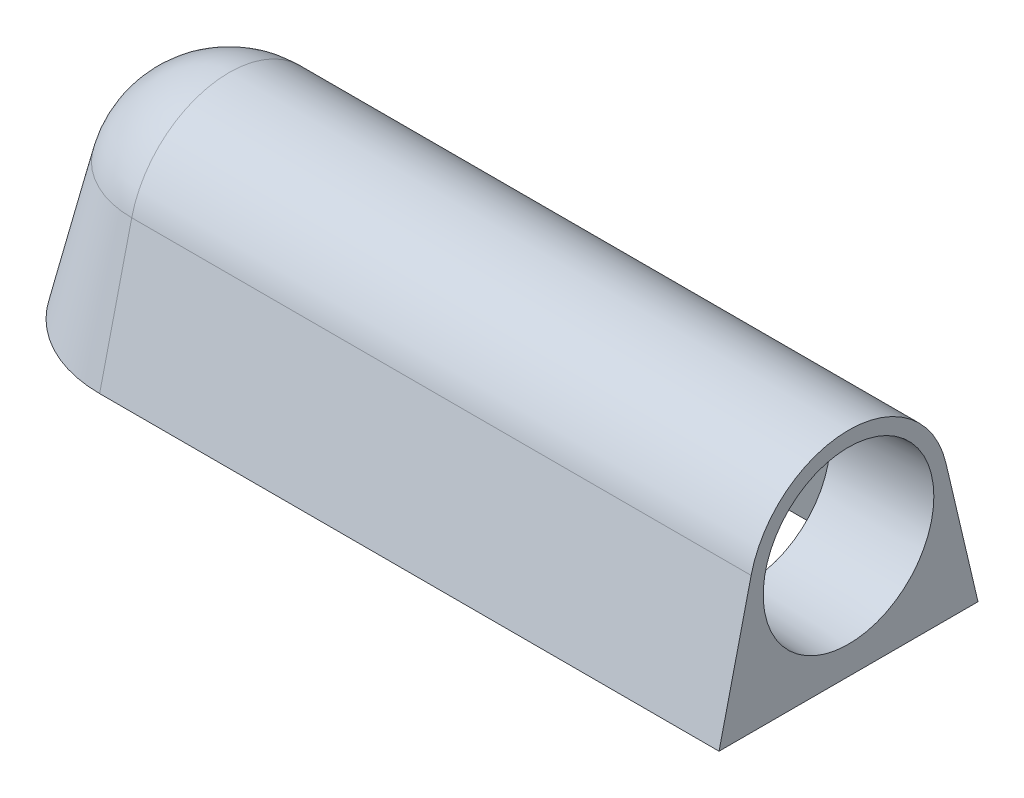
ISO-10303-21;
HEADER;
FILE_DESCRIPTION(('STEP AP214'),'2;1');
FILE_NAME('part.step','',(''),(''),'','','');
FILE_SCHEMA(('AUTOMOTIVE_DESIGN { 1 0 10303 214 1 1 1 1 }'));
ENDSEC;
DATA;
#1=APPLICATION_CONTEXT('core data for automotive mechanical design processes');
#2=APPLICATION_PROTOCOL_DEFINITION('international standard','automotive_design',2000,#1);
#3=PRODUCT_CONTEXT('',#1,'mechanical');
#4=PRODUCT('Part','Part','',(#3));
#5=PRODUCT_RELATED_PRODUCT_CATEGORY('part','',(#4));
#6=PRODUCT_DEFINITION_FORMATION('','',#4);
#7=PRODUCT_DEFINITION_CONTEXT('part definition',#1,'design');
#8=PRODUCT_DEFINITION('design','',#6,#7);
#9=PRODUCT_DEFINITION_SHAPE('','',#8);
#10=(LENGTH_UNIT() NAMED_UNIT(*) SI_UNIT(.MILLI.,.METRE.));
#11=(NAMED_UNIT(*) PLANE_ANGLE_UNIT() SI_UNIT($,.RADIAN.));
#12=(NAMED_UNIT(*) SI_UNIT($,.STERADIAN.) SOLID_ANGLE_UNIT());
#13=UNCERTAINTY_MEASURE_WITH_UNIT(LENGTH_MEASURE(1.E-05),#10,'distance_accuracy_value','');
#14=(GEOMETRIC_REPRESENTATION_CONTEXT(3) GLOBAL_UNCERTAINTY_ASSIGNED_CONTEXT((#13)) GLOBAL_UNIT_ASSIGNED_CONTEXT((#10,
#11,#12)) REPRESENTATION_CONTEXT('',''));
#15=CARTESIAN_POINT('',(0.,0.,0.));
#16=DIRECTION('',(0.,0.,1.));
#17=DIRECTION('',(1.,0.,0.));
#18=AXIS2_PLACEMENT_3D('',#15,#16,#17);
#19=CARTESIAN_POINT('',(0.,9.779,0.));
#20=DIRECTION('',(0.,-1.,0.));
#21=DIRECTION('',(0.,0.,1.));
#22=AXIS2_PLACEMENT_3D('',#19,#20,#21);
#23=SPHERICAL_SURFACE('',#22,8.636);
#24=CARTESIAN_POINT('',(0.,11.7591650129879,0.));
#25=DIRECTION('',(0.,-1.,0.));
#26=DIRECTION('',(0.,0.,-1.));
#27=AXIS2_PLACEMENT_3D('',#24,#25,#26);
#28=CIRCLE('',#27,8.40591711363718);
#29=CARTESIAN_POINT('',(0.,11.7591650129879,8.40591711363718));
#30=VERTEX_POINT('',#29);
#31=CARTESIAN_POINT('',(0.,11.7591650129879,-8.40591711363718));
#32=VERTEX_POINT('',#31);
#33=EDGE_CURVE('E11',#30,#32,#28,.T.);
#34=ORIENTED_EDGE('',*,*,#33,.F.);
#35=CARTESIAN_POINT('',(0.,9.779,0.));
#36=DIRECTION('',(-1.,0.,0.));
#37=DIRECTION('',(0.,0.,-1.));
#38=AXIS2_PLACEMENT_3D('',#35,#36,#37);
#39=CIRCLE('',#38,8.636);
#40=EDGE_CURVE('E223',#30,#32,#39,.T.);
#41=ORIENTED_EDGE('',*,*,#40,.T.);
#42=EDGE_LOOP('',(#34,#41));
#43=FACE_BOUND('',#42,.T.);
#44=ADVANCED_FACE('F28',(#43),#23,.T.);
#45=CARTESIAN_POINT('',(0.,0.,0.));
#46=DIRECTION('',(0.,-1.,0.));
#47=DIRECTION('',(0.,0.,-1.));
#48=AXIS2_PLACEMENT_3D('',#45,#46,#47);
#49=CONICAL_SURFACE('',#48,11.176,0.231350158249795);
#50=CARTESIAN_POINT('',(0.,0.,0.));
#51=DIRECTION('',(0.,-1.,0.));
#52=DIRECTION('',(0.,0.,-1.));
#53=AXIS2_PLACEMENT_3D('',#50,#51,#52);
#54=CIRCLE('',#53,11.176);
#55=CARTESIAN_POINT('',(0.,0.,11.176));
#56=VERTEX_POINT('',#55);
#57=CARTESIAN_POINT('',(0.,0.,-11.176));
#58=VERTEX_POINT('',#57);
#59=EDGE_CURVE('E35',#56,#58,#54,.T.);
#60=ORIENTED_EDGE('',*,*,#59,.F.);
#61=DIRECTION('',(0.,0.973357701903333,-0.229291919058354));
#62=VECTOR('',#61,1.);
#63=CARTESIAN_POINT('',(0.,11.7591650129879,8.40591711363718));
#64=LINE('',#63,#62);
#65=EDGE_CURVE('E219',#56,#30,#64,.T.);
#66=ORIENTED_EDGE('',*,*,#65,.T.);
#67=ORIENTED_EDGE('',*,*,#33,.T.);
#68=DIRECTION('',(0.,0.973357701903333,0.229291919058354));
#69=VECTOR('',#68,1.);
#70=CARTESIAN_POINT('',(0.,11.7591650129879,-8.40591711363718));
#71=LINE('',#70,#69);
#72=EDGE_CURVE('E220',#58,#32,#71,.T.);
#73=ORIENTED_EDGE('',*,*,#72,.F.);
#74=EDGE_LOOP('',(#60,#66,#67,#73));
#75=FACE_BOUND('',#74,.T.);
#76=ADVANCED_FACE('F206',(#75),#49,.T.);
#77=CARTESIAN_POINT('',(0.,0.,11.176));
#78=DIRECTION('',(0.,-1.,0.));
#79=DIRECTION('',(0.,0.,-1.));
#80=AXIS2_PLACEMENT_3D('',#77,#78,#79);
#81=PLANE('',#80);
#82=CARTESIAN_POINT('',(0.,0.,0.));
#83=DIRECTION('',(0.,-1.,0.));
#84=DIRECTION('',(0.,0.,-1.));
#85=AXIS2_PLACEMENT_3D('',#82,#83,#84);
#86=CIRCLE('',#85,9.87123814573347);
#87=CARTESIAN_POINT('',(0.,0.,9.87123814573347));
#88=VERTEX_POINT('',#87);
#89=CARTESIAN_POINT('',(0.,0.,-9.87123814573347));
#90=VERTEX_POINT('',#89);
#91=EDGE_CURVE('E125',#88,#90,#86,.T.);
#92=ORIENTED_EDGE('',*,*,#91,.F.);
#93=DIRECTION('',(-1.,0.,0.));
#94=VECTOR('',#93,1.);
#95=CARTESIAN_POINT('',(53.4670000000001,0.,9.87123814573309));
#96=LINE('',#95,#94);
#97=CARTESIAN_POINT('',(52.1970000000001,0.,9.8712381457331));
#98=VERTEX_POINT('',#97);
#99=EDGE_CURVE('E139',#98,#88,#96,.T.);
#100=ORIENTED_EDGE('',*,*,#99,.F.);
#101=DIRECTION('',(0.,0.,-1.));
#102=VECTOR('',#101,1.);
#103=CARTESIAN_POINT('',(52.197,0.,-3.66618171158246E-13));
#104=LINE('',#103,#102);
#105=CARTESIAN_POINT('',(52.1969999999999,0.,-9.87123814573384));
#106=VERTEX_POINT('',#105);
#107=EDGE_CURVE('E42',#98,#106,#104,.T.);
#108=ORIENTED_EDGE('',*,*,#107,.T.);
#109=DIRECTION('',(-1.,0.,0.));
#110=VECTOR('',#109,1.);
#111=CARTESIAN_POINT('',(0.,0.,-9.87123814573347));
#112=LINE('',#111,#110);
#113=EDGE_CURVE('E147',#106,#90,#112,.T.);
#114=ORIENTED_EDGE('',*,*,#113,.T.);
#115=EDGE_LOOP('',(#92,#100,#108,#114));
#116=FACE_BOUND('',#115,.T.);
#117=ORIENTED_EDGE('',*,*,#59,.T.);
#118=DIRECTION('',(-1.,0.,0.));
#119=VECTOR('',#118,1.);
#120=CARTESIAN_POINT('',(53.4669999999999,0.,-11.1760000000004));
#121=LINE('',#120,#119);
#122=CARTESIAN_POINT('',(53.4669999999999,0.,-11.1760000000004));
#123=VERTEX_POINT('',#122);
#124=EDGE_CURVE('E231',#123,#58,#121,.T.);
#125=ORIENTED_EDGE('',*,*,#124,.F.);
#126=DIRECTION('',(0.,0.,-1.));
#127=VECTOR('',#126,1.);
#128=CARTESIAN_POINT('',(53.4670000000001,0.,11.1759999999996));
#129=LINE('',#128,#127);
#130=CARTESIAN_POINT('',(53.4670000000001,0.,11.1759999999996));
#131=VERTEX_POINT('',#130);
#132=EDGE_CURVE('E241',#131,#123,#129,.T.);
#133=ORIENTED_EDGE('',*,*,#132,.F.);
#134=DIRECTION('',(-1.,0.,0.));
#135=VECTOR('',#134,1.);
#136=CARTESIAN_POINT('',(53.4670000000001,0.,11.1759999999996));
#137=LINE('',#136,#135);
#138=EDGE_CURVE('E229',#131,#56,#137,.T.);
#139=ORIENTED_EDGE('',*,*,#138,.T.);
#140=EDGE_LOOP('',(#117,#125,#133,#139));
#141=FACE_BOUND('',#140,.T.);
#142=ADVANCED_FACE('F203',(#116,#141),#81,.T.);
#143=CARTESIAN_POINT('',(53.4670000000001,11.7591650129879,8.40591711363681));
#144=DIRECTION('',(0.,-0.229291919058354,-0.973357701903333));
#145=DIRECTION('',(0.,0.973357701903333,-0.229291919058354));
#146=AXIS2_PLACEMENT_3D('',#143,#144,#145);
#147=PLANE('',#146);
#148=ORIENTED_EDGE('',*,*,#65,.F.);
#149=ORIENTED_EDGE('',*,*,#138,.F.);
#150=DIRECTION('',(0.,-0.973357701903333,0.229291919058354));
#151=VECTOR('',#150,1.);
#152=CARTESIAN_POINT('',(53.4670000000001,11.7591650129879,8.40591711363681));
#153=LINE('',#152,#151);
#154=CARTESIAN_POINT('',(53.4670000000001,11.7591650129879,8.40591711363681));
#155=VERTEX_POINT('',#154);
#156=EDGE_CURVE('E243',#155,#131,#153,.T.);
#157=ORIENTED_EDGE('',*,*,#156,.F.);
#158=DIRECTION('',(-1.,0.,0.));
#159=VECTOR('',#158,1.);
#160=CARTESIAN_POINT('',(53.4670000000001,11.7591650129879,8.40591711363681));
#161=LINE('',#160,#159);
#162=EDGE_CURVE('E234',#155,#30,#161,.T.);
#163=ORIENTED_EDGE('',*,*,#162,.T.);
#164=EDGE_LOOP('',(#148,#149,#157,#163));
#165=FACE_BOUND('',#164,.T.);
#166=ADVANCED_FACE('F199',(#165),#147,.F.);
#167=CARTESIAN_POINT('',(53.4669999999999,0.,-11.1760000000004));
#168=DIRECTION('',(0.,-0.229291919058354,0.973357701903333));
#169=DIRECTION('',(0.,-0.973357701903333,-0.229291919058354));
#170=AXIS2_PLACEMENT_3D('',#167,#168,#169);
#171=PLANE('',#170);
#172=ORIENTED_EDGE('',*,*,#72,.T.);
#173=DIRECTION('',(-1.,0.,0.));
#174=VECTOR('',#173,1.);
#175=CARTESIAN_POINT('',(53.4669999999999,11.7591650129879,-8.40591711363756));
#176=LINE('',#175,#174);
#177=CARTESIAN_POINT('',(53.4669999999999,11.7591650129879,-8.40591711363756));
#178=VERTEX_POINT('',#177);
#179=EDGE_CURVE('E50',#178,#32,#176,.T.);
#180=ORIENTED_EDGE('',*,*,#179,.F.);
#181=DIRECTION('',(0.,0.973357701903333,0.229291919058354));
#182=VECTOR('',#181,1.);
#183=CARTESIAN_POINT('',(53.4669999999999,0.,-11.1760000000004));
#184=LINE('',#183,#182);
#185=EDGE_CURVE('E239',#123,#178,#184,.T.);
#186=ORIENTED_EDGE('',*,*,#185,.F.);
#187=ORIENTED_EDGE('',*,*,#124,.T.);
#188=EDGE_LOOP('',(#172,#180,#186,#187));
#189=FACE_BOUND('',#188,.T.);
#190=ADVANCED_FACE('F196',(#189),#171,.F.);
#191=CARTESIAN_POINT('',(53.467,9.779,-3.75554089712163E-13));
#192=DIRECTION('',(-1.,0.,0.));
#193=DIRECTION('',(0.,0.,1.));
#194=AXIS2_PLACEMENT_3D('',#191,#192,#193);
#195=CYLINDRICAL_SURFACE('',#194,8.636);
#196=ORIENTED_EDGE('',*,*,#40,.F.);
#197=ORIENTED_EDGE('',*,*,#162,.F.);
#198=CARTESIAN_POINT('',(53.467,9.779,-3.75554089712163E-13));
#199=DIRECTION('',(1.,0.,0.));
#200=DIRECTION('',(0.,0.,-1.));
#201=AXIS2_PLACEMENT_3D('',#198,#199,#200);
#202=CIRCLE('',#201,8.636);
#203=EDGE_CURVE('E237',#178,#155,#202,.T.);
#204=ORIENTED_EDGE('',*,*,#203,.F.);
#205=ORIENTED_EDGE('',*,*,#179,.T.);
#206=EDGE_LOOP('',(#196,#197,#204,#205));
#207=FACE_BOUND('',#206,.T.);
#208=ADVANCED_FACE('F192',(#207),#195,.T.);
#209=CARTESIAN_POINT('',(53.467,9.779,-3.75554089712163E-13));
#210=DIRECTION('',(1.,0.,0.));
#211=DIRECTION('',(0.,0.,-1.));
#212=AXIS2_PLACEMENT_3D('',#209,#210,#211);
#213=PLANE('',#212);
#214=CARTESIAN_POINT('',(53.4669999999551,9.779,-3.75567632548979E-13));
#215=DIRECTION('',(1.,0.,0.));
#216=DIRECTION('',(0.,0.,-1.));
#217=AXIS2_PLACEMENT_3D('',#214,#215,#216);
#218=CIRCLE('',#217,7.366);
#219=CARTESIAN_POINT('',(53.466999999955,9.779,-7.36600000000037));
#220=VERTEX_POINT('',#219);
#221=EDGE_CURVE('E246',#220,#220,#218,.T.);
#222=ORIENTED_EDGE('',*,*,#221,.F.);
#223=EDGE_LOOP('',(#222));
#224=FACE_BOUND('',#223,.T.);
#225=ORIENTED_EDGE('',*,*,#156,.T.);
#226=ORIENTED_EDGE('',*,*,#132,.T.);
#227=ORIENTED_EDGE('',*,*,#185,.T.);
#228=ORIENTED_EDGE('',*,*,#203,.T.);
#229=EDGE_LOOP('',(#225,#226,#227,#228));
#230=FACE_BOUND('',#229,.T.);
#231=ADVANCED_FACE('F188',(#224,#230),#213,.T.);
#232=CARTESIAN_POINT('',(53.4669999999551,9.779,-3.75567632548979E-13));
#233=DIRECTION('',(1.,0.,0.));
#234=DIRECTION('',(0.,0.,-1.));
#235=AXIS2_PLACEMENT_3D('',#232,#233,#234);
#236=CONICAL_SURFACE('',#235,7.366,0.0349065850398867);
#237=CARTESIAN_POINT('',(44.8309999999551,9.779,-3.14733946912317E-13));
#238=DIRECTION('',(1.,0.,0.));
#239=DIRECTION('',(0.,0.,-1.));
#240=AXIS2_PLACEMENT_3D('',#237,#238,#239);
#241=CIRCLE('',#240,7.06442423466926);
#242=CARTESIAN_POINT('',(44.830999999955,9.779,-7.06442423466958));
#243=VERTEX_POINT('',#242);
#244=EDGE_CURVE('E247',#243,#243,#241,.T.);
#245=ORIENTED_EDGE('',*,*,#244,.F.);
#246=EDGE_LOOP('',(#245));
#247=FACE_BOUND('',#246,.T.);
#248=ORIENTED_EDGE('',*,*,#221,.T.);
#249=EDGE_LOOP('',(#248));
#250=FACE_BOUND('',#249,.T.);
#251=ADVANCED_FACE('F184',(#247,#250),#236,.F.);
#252=CARTESIAN_POINT('',(53.4670000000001,11.4679642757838,7.16975283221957));
#253=DIRECTION('',(0.,-0.229291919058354,-0.973357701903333));
#254=DIRECTION('',(0.,0.973357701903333,-0.229291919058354));
#255=AXIS2_PLACEMENT_3D('',#252,#253,#254);
#256=PLANE('',#255);
#257=DIRECTION('',(0.,-0.973357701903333,0.229291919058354));
#258=VECTOR('',#257,1.);
#259=CARTESIAN_POINT('',(44.8309999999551,11.4679642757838,7.16975283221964));
#260=LINE('',#259,#258);
#261=CARTESIAN_POINT('',(44.8309999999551,11.4679642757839,7.16975283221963));
#262=VERTEX_POINT('',#261);
#263=CARTESIAN_POINT('',(44.8309999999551,7.67092399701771,8.0642139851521));
#264=VERTEX_POINT('',#263);
#265=EDGE_CURVE('E254',#262,#264,#260,.T.);
#266=ORIENTED_EDGE('',*,*,#265,.T.);
#267=CARTESIAN_POINT('',(64.8988137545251,6.37375820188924,8.36978472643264));
#268=CARTESIAN_POINT('',(63.8400878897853,6.43589244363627,8.35514788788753));
#269=CARTESIAN_POINT('',(62.7814084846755,6.49877232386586,8.34033540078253));
#270=CARTESIAN_POINT('',(60.66415634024,6.62622021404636,8.31031275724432));
#271=CARTESIAN_POINT('',(59.6055836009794,6.69078822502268,8.29510260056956));
#272=CARTESIAN_POINT('',(56.4301040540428,6.88731614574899,8.24880691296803));
#273=CARTESIAN_POINT('',(54.3133797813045,7.02210321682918,8.21705539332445));
#274=CARTESIAN_POINT('',(51.1387936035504,7.23168907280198,8.16768367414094));
#275=CARTESIAN_POINT('',(50.0806733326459,7.30278581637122,8.15093555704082));
#276=CARTESIAN_POINT('',(47.964643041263,7.44787082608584,8.11675817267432));
#277=CARTESIAN_POINT('',(46.9067330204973,7.52185908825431,8.09932890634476));
#278=CARTESIAN_POINT('',(44.7911413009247,7.6732317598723,8.06367035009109));
#279=CARTESIAN_POINT('',(43.7334596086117,7.75061625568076,8.04544103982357));
#280=CARTESIAN_POINT('',(41.6184195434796,7.90952092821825,8.00800818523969));
#281=CARTESIAN_POINT('',(40.5610611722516,7.99104112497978,7.98880463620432));
#282=CARTESIAN_POINT('',(39.5039036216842,8.07499944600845,7.96902674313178));
#283=B_SPLINE_CURVE_WITH_KNOTS('',3,(#267,#268,#269,#270,#271,#272,#273,#274,#275,#276,#277,
#278,#279,#280,#281,#282),.UNSPECIFIED.,.F.,.F.,(4,2,2,2,2,2,2,4),(0.,3.18194466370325,
6.36389126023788,12.7276157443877,15.9095276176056,19.0914351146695,22.2734235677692,
25.4554274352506),.UNSPECIFIED.);
#284=CARTESIAN_POINT('',(52.1970000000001,7.16182639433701,8.18414108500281));
#285=VERTEX_POINT('',#284);
#286=EDGE_CURVE('E135',#285,#264,#283,.T.);
#287=ORIENTED_EDGE('',*,*,#286,.F.);
#288=DIRECTION('',(0.,-0.973357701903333,0.229291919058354));
#289=VECTOR('',#288,1.);
#290=CARTESIAN_POINT('',(52.197,11.4679642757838,7.16975283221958));
#291=LINE('',#290,#289);
#292=EDGE_CURVE('E143',#285,#98,#291,.T.);
#293=ORIENTED_EDGE('',*,*,#292,.T.);
#294=ORIENTED_EDGE('',*,*,#99,.T.);
#295=DIRECTION('',(0.,-0.973357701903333,0.229291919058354));
#296=VECTOR('',#295,1.);
#297=CARTESIAN_POINT('',(0.,-0.29120073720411,9.93983571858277));
#298=LINE('',#297,#296);
#299=CARTESIAN_POINT('',(0.,11.4679642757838,7.16975283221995));
#300=VERTEX_POINT('',#299);
#301=EDGE_CURVE('E126',#88,#300,#298,.F.);
#302=ORIENTED_EDGE('',*,*,#301,.T.);
#303=DIRECTION('',(1.,0.,0.));
#304=VECTOR('',#303,1.);
#305=CARTESIAN_POINT('',(53.4670000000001,11.4679642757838,7.16975283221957));
#306=LINE('',#305,#304);
#307=EDGE_CURVE('E107',#262,#300,#306,.F.);
#308=ORIENTED_EDGE('',*,*,#307,.F.);
#309=EDGE_LOOP('',(#266,#287,#293,#294,#302,#308));
#310=FACE_BOUND('',#309,.T.);
#311=ADVANCED_FACE('F137',(#310),#256,.T.);
#312=CARTESIAN_POINT('',(0.,9.779,0.));
#313=DIRECTION('',(0.,-1.,0.));
#314=DIRECTION('',(0.,0.,1.));
#315=AXIS2_PLACEMENT_3D('',#312,#313,#314);
#316=SPHERICAL_SURFACE('',#315,7.366);
#317=CARTESIAN_POINT('',(0.,11.4679642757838,0.));
#318=DIRECTION('',(0.,-1.,0.));
#319=DIRECTION('',(0.,0.,-1.));
#320=AXIS2_PLACEMENT_3D('',#317,#318,#319);
#321=CIRCLE('',#320,7.16975283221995);
#322=CARTESIAN_POINT('',(0.,11.4679642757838,-7.16975283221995));
#323=VERTEX_POINT('',#322);
#324=EDGE_CURVE('E124',#300,#323,#321,.T.);
#325=ORIENTED_EDGE('',*,*,#324,.T.);
#326=CARTESIAN_POINT('',(0.,9.779,0.));
#327=DIRECTION('',(-1.,0.,0.));
#328=DIRECTION('',(0.,0.,1.));
#329=AXIS2_PLACEMENT_3D('',#326,#327,#328);
#330=CIRCLE('',#329,7.366);
#331=EDGE_CURVE('E111',#300,#323,#330,.T.);
#332=ORIENTED_EDGE('',*,*,#331,.F.);
#333=EDGE_LOOP('',(#325,#332));
#334=FACE_BOUND('',#333,.T.);
#335=ADVANCED_FACE('F123',(#334),#316,.F.);
#336=CARTESIAN_POINT('',(0.,-0.29120073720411,0.));
#337=DIRECTION('',(0.,-1.,0.));
#338=DIRECTION('',(0.,0.,-1.));
#339=AXIS2_PLACEMENT_3D('',#336,#337,#338);
#340=CONICAL_SURFACE('',#339,9.93983571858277,0.231350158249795);
#341=ORIENTED_EDGE('',*,*,#91,.T.);
#342=DIRECTION('',(0.,-0.973357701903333,-0.229291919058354));
#343=VECTOR('',#342,1.);
#344=CARTESIAN_POINT('',(0.,-0.291200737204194,-9.93983571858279));
#345=LINE('',#344,#343);
#346=EDGE_CURVE('E134',#90,#323,#345,.F.);
#347=ORIENTED_EDGE('',*,*,#346,.T.);
#348=ORIENTED_EDGE('',*,*,#324,.F.);
#349=ORIENTED_EDGE('',*,*,#301,.F.);
#350=EDGE_LOOP('',(#341,#347,#348,#349));
#351=FACE_BOUND('',#350,.T.);
#352=ADVANCED_FACE('F131',(#351),#340,.F.);
#353=CARTESIAN_POINT('',(53.4669999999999,-0.29120073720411,-9.93983571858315));
#354=DIRECTION('',(0.,-0.229291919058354,0.973357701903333));
#355=DIRECTION('',(0.,-0.973357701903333,-0.229291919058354));
#356=AXIS2_PLACEMENT_3D('',#353,#354,#355);
#357=PLANE('',#356);
#358=DIRECTION('',(-1.,0.,0.));
#359=VECTOR('',#358,1.);
#360=CARTESIAN_POINT('',(53.4669999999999,11.4679642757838,-7.16975283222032));
#361=LINE('',#360,#359);
#362=CARTESIAN_POINT('',(44.830999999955,11.4679642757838,-7.16975283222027));
#363=VERTEX_POINT('',#362);
#364=EDGE_CURVE('E118',#363,#323,#361,.T.);
#365=ORIENTED_EDGE('',*,*,#364,.T.);
#366=ORIENTED_EDGE('',*,*,#346,.F.);
#367=ORIENTED_EDGE('',*,*,#113,.F.);
#368=DIRECTION('',(0.,0.973357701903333,0.229291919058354));
#369=VECTOR('',#368,1.);
#370=CARTESIAN_POINT('',(52.1969999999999,-0.29120073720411,-9.93983571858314));
#371=LINE('',#370,#369);
#372=CARTESIAN_POINT('',(52.1969999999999,7.16182639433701,-8.18414108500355));
#373=VERTEX_POINT('',#372);
#374=EDGE_CURVE('E119',#106,#373,#371,.T.);
#375=ORIENTED_EDGE('',*,*,#374,.T.);
#376=CARTESIAN_POINT('',(64.8988137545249,6.37375820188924,-8.36978472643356));
#377=CARTESIAN_POINT('',(63.8400878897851,6.43589244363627,-8.35514788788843));
#378=CARTESIAN_POINT('',(62.7814084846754,6.49877232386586,-8.34033540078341));
#379=CARTESIAN_POINT('',(60.6641563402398,6.62622021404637,-8.31031275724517));
#380=CARTESIAN_POINT('',(59.6055836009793,6.69078822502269,-8.2951026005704));
#381=CARTESIAN_POINT('',(56.4301040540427,6.88731614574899,-8.24880691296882));
#382=CARTESIAN_POINT('',(54.3133797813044,7.02210321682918,-8.21705539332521));
#383=CARTESIAN_POINT('',(51.1387936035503,7.23168907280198,-8.16768367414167));
#384=CARTESIAN_POINT('',(50.0806733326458,7.30278581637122,-8.15093555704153));
#385=CARTESIAN_POINT('',(47.9646430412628,7.44787082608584,-8.11675817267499));
#386=CARTESIAN_POINT('',(46.9067330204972,7.52185908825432,-8.09932890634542));
#387=CARTESIAN_POINT('',(44.7911413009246,7.6732317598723,-8.06367035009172));
#388=CARTESIAN_POINT('',(43.7334596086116,7.75061625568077,-8.04544103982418));
#389=CARTESIAN_POINT('',(41.6184195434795,7.90952092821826,-8.00800818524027));
#390=CARTESIAN_POINT('',(40.5610611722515,7.99104112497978,-7.98880463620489));
#391=CARTESIAN_POINT('',(39.5039036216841,8.07499944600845,-7.96902674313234));
#392=B_SPLINE_CURVE_WITH_KNOTS('',3,(#376,#377,#378,#379,#380,#381,#382,#383,#384,#385,#386,
#387,#388,#389,#390,#391),.UNSPECIFIED.,.F.,.F.,(4,2,2,2,2,2,2,4),(0.,3.18194466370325,
6.36389126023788,12.7276157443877,15.9095276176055,19.0914351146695,22.2734235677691,
25.4554274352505),.UNSPECIFIED.);
#393=CARTESIAN_POINT('',(44.830999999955,7.67092399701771,-8.06421398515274));
#394=VERTEX_POINT('',#393);
#395=EDGE_CURVE('E167',#373,#394,#392,.T.);
#396=ORIENTED_EDGE('',*,*,#395,.T.);
#397=DIRECTION('',(0.,-0.973357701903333,-0.229291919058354));
#398=VECTOR('',#397,1.);
#399=CARTESIAN_POINT('',(44.830999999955,11.4679642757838,-7.16975283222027));
#400=LINE('',#399,#398);
#401=EDGE_CURVE('E253',#363,#394,#400,.T.);
#402=ORIENTED_EDGE('',*,*,#401,.F.);
#403=EDGE_LOOP('',(#365,#366,#367,#375,#396,#402));
#404=FACE_BOUND('',#403,.T.);
#405=ADVANCED_FACE('F257',(#404),#357,.T.);
#406=CARTESIAN_POINT('',(53.467,9.779,-3.75554089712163E-13));
#407=DIRECTION('',(-1.,0.,0.));
#408=DIRECTION('',(0.,0.,1.));
#409=AXIS2_PLACEMENT_3D('',#406,#407,#408);
#410=CYLINDRICAL_SURFACE('',#409,7.366);
#411=ORIENTED_EDGE('',*,*,#307,.T.);
#412=ORIENTED_EDGE('',*,*,#331,.T.);
#413=ORIENTED_EDGE('',*,*,#364,.F.);
#414=CARTESIAN_POINT('',(44.8309999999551,9.779,-3.14720404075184E-13));
#415=DIRECTION('',(1.,0.,0.));
#416=DIRECTION('',(0.,0.,-1.));
#417=AXIS2_PLACEMENT_3D('',#414,#415,#416);
#418=CIRCLE('',#417,7.366);
#419=EDGE_CURVE('E114',#262,#363,#418,.F.);
#420=ORIENTED_EDGE('',*,*,#419,.F.);
#421=EDGE_LOOP('',(#411,#412,#413,#420));
#422=FACE_BOUND('',#421,.T.);
#423=ADVANCED_FACE('F109',(#422),#410,.F.);
#424=CARTESIAN_POINT('',(52.197,9.779,-3.66607959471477E-13));
#425=DIRECTION('',(1.,0.,0.));
#426=DIRECTION('',(0.,0.,-1.));
#427=AXIS2_PLACEMENT_3D('',#424,#425,#426);
#428=PLANE('',#427);
#429=CARTESIAN_POINT('',(52.197,9.779,-3.6662150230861E-13));
#430=DIRECTION('',(1.,0.,0.));
#431=DIRECTION('',(0.,0.,-1.));
#432=AXIS2_PLACEMENT_3D('',#429,#430,#431);
#433=CIRCLE('',#432,8.59242474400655);
#434=EDGE_CURVE('E150',#285,#373,#433,.T.);
#435=ORIENTED_EDGE('',*,*,#434,.T.);
#436=ORIENTED_EDGE('',*,*,#374,.F.);
#437=ORIENTED_EDGE('',*,*,#107,.F.);
#438=ORIENTED_EDGE('',*,*,#292,.F.);
#439=EDGE_LOOP('',(#435,#436,#437,#438));
#440=FACE_BOUND('',#439,.T.);
#441=ADVANCED_FACE('F181',(#440),#428,.F.);
#442=CARTESIAN_POINT('',(53.4226776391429,9.779,-3.75255417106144E-13));
#443=DIRECTION('',(1.,0.,0.));
#444=DIRECTION('',(0.,0.,-1.));
#445=AXIS2_PLACEMENT_3D('',#442,#443,#444);
#446=CONICAL_SURFACE('',#445,8.63522635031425,0.0349065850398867);
#447=ORIENTED_EDGE('',*,*,#434,.F.);
#448=ORIENTED_EDGE('',*,*,#286,.T.);
#449=CARTESIAN_POINT('',(44.8309999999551,9.779,-3.14733946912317E-13));
#450=DIRECTION('',(1.,0.,0.));
#451=DIRECTION('',(0.,0.,-1.));
#452=AXIS2_PLACEMENT_3D('',#449,#450,#451);
#453=CIRCLE('',#452,8.33519835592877);
#454=EDGE_CURVE('E144',#264,#394,#453,.T.);
#455=ORIENTED_EDGE('',*,*,#454,.T.);
#456=ORIENTED_EDGE('',*,*,#395,.F.);
#457=EDGE_LOOP('',(#447,#448,#455,#456));
#458=FACE_BOUND('',#457,.T.);
#459=ADVANCED_FACE('F175',(#458),#446,.T.);
#460=CARTESIAN_POINT('',(44.8309999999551,9.779,-3.14733946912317E-13));
#461=DIRECTION('',(1.,0.,0.));
#462=DIRECTION('',(0.,0.,-1.));
#463=AXIS2_PLACEMENT_3D('',#460,#461,#462);
#464=PLANE('',#463);
#465=ORIENTED_EDGE('',*,*,#244,.T.);
#466=EDGE_LOOP('',(#465));
#467=FACE_BOUND('',#466,.T.);
#468=ORIENTED_EDGE('',*,*,#419,.T.);
#469=ORIENTED_EDGE('',*,*,#401,.T.);
#470=ORIENTED_EDGE('',*,*,#454,.F.);
#471=ORIENTED_EDGE('',*,*,#265,.F.);
#472=EDGE_LOOP('',(#468,#469,#470,#471));
#473=FACE_BOUND('',#472,.T.);
#474=ADVANCED_FACE('F180',(#467,#473),#464,.F.);
#475=CLOSED_SHELL('',(#44,#76,#142,#166,#190,#208,#231,#251,#311,#335,#352,#405,#423,#441,#459,#474));
#476=MANIFOLD_SOLID_BREP('B2',#475);
#477=ADVANCED_BREP_SHAPE_REPRESENTATION('',(#18,#476),#14);
#478=SHAPE_DEFINITION_REPRESENTATION(#9,#477);
ENDSEC;
END-ISO-10303-21;
